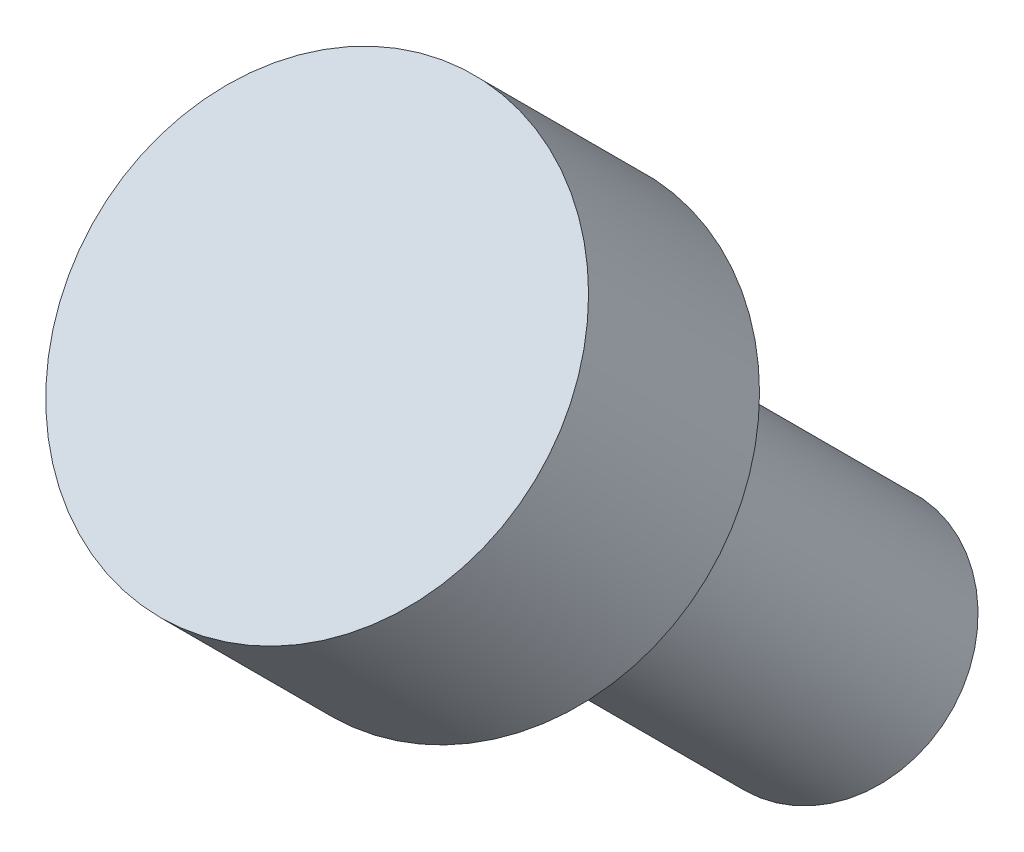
ISO-10303-21;
HEADER;
FILE_DESCRIPTION(('STEP AP214'),'2;1');
FILE_NAME('part.step','',(''),(''),'','','');
FILE_SCHEMA(('AUTOMOTIVE_DESIGN { 1 0 10303 214 1 1 1 1 }'));
ENDSEC;
DATA;
#1=APPLICATION_CONTEXT('core data for automotive mechanical design processes');
#2=APPLICATION_PROTOCOL_DEFINITION('international standard','automotive_design',2000,#1);
#3=PRODUCT_CONTEXT('',#1,'mechanical');
#4=PRODUCT('Part','Part','',(#3));
#5=PRODUCT_RELATED_PRODUCT_CATEGORY('part','',(#4));
#6=PRODUCT_DEFINITION_FORMATION('','',#4);
#7=PRODUCT_DEFINITION_CONTEXT('part definition',#1,'design');
#8=PRODUCT_DEFINITION('design','',#6,#7);
#9=PRODUCT_DEFINITION_SHAPE('','',#8);
#10=(LENGTH_UNIT() NAMED_UNIT(*) SI_UNIT(.MILLI.,.METRE.));
#11=(NAMED_UNIT(*) PLANE_ANGLE_UNIT() SI_UNIT($,.RADIAN.));
#12=(NAMED_UNIT(*) SI_UNIT($,.STERADIAN.) SOLID_ANGLE_UNIT());
#13=UNCERTAINTY_MEASURE_WITH_UNIT(LENGTH_MEASURE(1.E-05),#10,'distance_accuracy_value','');
#14=(GEOMETRIC_REPRESENTATION_CONTEXT(3) GLOBAL_UNCERTAINTY_ASSIGNED_CONTEXT((#13)) GLOBAL_UNIT_ASSIGNED_CONTEXT((#10,
#11,#12)) REPRESENTATION_CONTEXT('',''));
#15=CARTESIAN_POINT('',(0.,0.,0.));
#16=DIRECTION('',(0.,0.,1.));
#17=DIRECTION('',(1.,0.,0.));
#18=AXIS2_PLACEMENT_3D('',#15,#16,#17);
#19=CARTESIAN_POINT('',(0.,-60.40416305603,-24.40416305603));
#20=DIRECTION('',(0.,-0.707106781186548,-0.707106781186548));
#21=DIRECTION('',(0.,-0.707106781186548,0.707106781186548));
#22=AXIS2_PLACEMENT_3D('',#19,#20,#21);
#23=PLANE('',#22);
#24=CARTESIAN_POINT('',(0.,-60.40416305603,-24.40416305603));
#25=DIRECTION('',(0.,-0.707106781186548,-0.707106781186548));
#26=DIRECTION('',(0.,-0.707106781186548,0.707106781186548));
#27=AXIS2_PLACEMENT_3D('',#24,#25,#26);
#28=CIRCLE('',#27,1.5);
#29=CARTESIAN_POINT('',(0.,-61.46482322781,-23.34350288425));
#30=VERTEX_POINT('',#29);
#31=EDGE_CURVE('E25',#30,#30,#28,.T.);
#32=ORIENTED_EDGE('',*,*,#31,.T.);
#33=EDGE_LOOP('',(#32));
#34=FACE_BOUND('',#33,.T.);
#35=ADVANCED_FACE('F16',(#34),#23,.T.);
#36=CARTESIAN_POINT('',(0.,-56.16152236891,-20.16152236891));
#37=DIRECTION('',(0.,-0.707106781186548,-0.707106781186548));
#38=DIRECTION('',(0.,-0.707106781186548,0.707106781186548));
#39=AXIS2_PLACEMENT_3D('',#36,#37,#38);
#40=CYLINDRICAL_SURFACE('',#39,1.5);
#41=ORIENTED_EDGE('',*,*,#31,.F.);
#42=DIRECTION('',(0.,-0.707106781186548,-0.707106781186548));
#43=VECTOR('',#42,1.);
#44=CARTESIAN_POINT('',(0.,-57.22218254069,-19.10086219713));
#45=LINE('',#44,#43);
#46=CARTESIAN_POINT('',(0.,-57.22218254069,-19.10086219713));
#47=VERTEX_POINT('',#46);
#48=EDGE_CURVE('E10',#47,#30,#45,.T.);
#49=ORIENTED_EDGE('',*,*,#48,.F.);
#50=CARTESIAN_POINT('',(0.,-56.16152236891,-20.16152236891));
#51=DIRECTION('',(0.,-0.707106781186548,-0.707106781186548));
#52=DIRECTION('',(0.,-0.707106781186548,0.707106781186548));
#53=AXIS2_PLACEMENT_3D('',#50,#51,#52);
#54=CIRCLE('',#53,1.5);
#55=EDGE_CURVE('E65',#47,#47,#54,.T.);
#56=ORIENTED_EDGE('',*,*,#55,.T.);
#57=ORIENTED_EDGE('',*,*,#48,.T.);
#58=EDGE_LOOP('',(#41,#49,#56,#57));
#59=FACE_BOUND('',#58,.T.);
#60=ADVANCED_FACE('F70',(#59),#40,.T.);
#61=CARTESIAN_POINT('',(0.,-54.04020202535,-18.04020202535));
#62=DIRECTION('',(0.,-0.707106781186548,-0.707106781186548));
#63=DIRECTION('',(0.,-0.707106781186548,0.707106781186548));
#64=AXIS2_PLACEMENT_3D('',#61,#62,#63);
#65=PLANE('',#64);
#66=CARTESIAN_POINT('',(0.,-54.04020202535,-18.04020202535));
#67=DIRECTION('',(0.,-0.707106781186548,-0.707106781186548));
#68=DIRECTION('',(0.,-0.707106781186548,0.707106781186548));
#69=AXIS2_PLACEMENT_3D('',#66,#67,#68);
#70=CIRCLE('',#69,2.75);
#71=CARTESIAN_POINT('',(0.,-55.98474567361,-16.09565837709));
#72=VERTEX_POINT('',#71);
#73=EDGE_CURVE('E19',#72,#72,#70,.T.);
#74=ORIENTED_EDGE('',*,*,#73,.F.);
#75=EDGE_LOOP('',(#74));
#76=FACE_BOUND('',#75,.T.);
#77=ADVANCED_FACE('F72',(#76),#65,.F.);
#78=CARTESIAN_POINT('',(0.,-56.16152236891,-20.16152236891));
#79=DIRECTION('',(0.,-0.707106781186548,-0.707106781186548));
#80=DIRECTION('',(0.,-0.707106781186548,0.707106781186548));
#81=AXIS2_PLACEMENT_3D('',#78,#79,#80);
#82=PLANE('',#81);
#83=ORIENTED_EDGE('',*,*,#55,.F.);
#84=EDGE_LOOP('',(#83));
#85=FACE_BOUND('',#84,.T.);
#86=CARTESIAN_POINT('',(0.,-56.16152236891,-20.16152236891));
#87=DIRECTION('',(0.,-0.707106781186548,-0.707106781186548));
#88=DIRECTION('',(0.,-0.707106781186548,0.707106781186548));
#89=AXIS2_PLACEMENT_3D('',#86,#87,#88);
#90=CIRCLE('',#89,2.75);
#91=CARTESIAN_POINT('',(0.,-58.10606601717,-18.21697872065));
#92=VERTEX_POINT('',#91);
#93=EDGE_CURVE('E54',#92,#92,#90,.T.);
#94=ORIENTED_EDGE('',*,*,#93,.T.);
#95=EDGE_LOOP('',(#94));
#96=FACE_BOUND('',#95,.T.);
#97=ADVANCED_FACE('F59',(#85,#96),#82,.T.);
#98=CARTESIAN_POINT('',(0.,-54.04020202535,-18.04020202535));
#99=DIRECTION('',(0.,-0.707106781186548,-0.707106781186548));
#100=DIRECTION('',(0.,-0.707106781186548,0.707106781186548));
#101=AXIS2_PLACEMENT_3D('',#98,#99,#100);
#102=CYLINDRICAL_SURFACE('',#101,2.75);
#103=ORIENTED_EDGE('',*,*,#93,.F.);
#104=DIRECTION('',(0.,-0.707106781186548,-0.707106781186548));
#105=VECTOR('',#104,1.);
#106=CARTESIAN_POINT('',(0.,-55.98474567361,-16.09565837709));
#107=LINE('',#106,#105);
#108=EDGE_CURVE('E51',#72,#92,#107,.T.);
#109=ORIENTED_EDGE('',*,*,#108,.F.);
#110=ORIENTED_EDGE('',*,*,#73,.T.);
#111=ORIENTED_EDGE('',*,*,#108,.T.);
#112=EDGE_LOOP('',(#103,#109,#110,#111));
#113=FACE_BOUND('',#112,.T.);
#114=ADVANCED_FACE('F53',(#113),#102,.T.);
#115=CLOSED_SHELL('',(#35,#60,#77,#97,#114));
#116=MANIFOLD_SOLID_BREP('B1',#115);
#117=ADVANCED_BREP_SHAPE_REPRESENTATION('',(#18,#116),#14);
#118=SHAPE_DEFINITION_REPRESENTATION(#9,#117);
ENDSEC;
END-ISO-10303-21;
